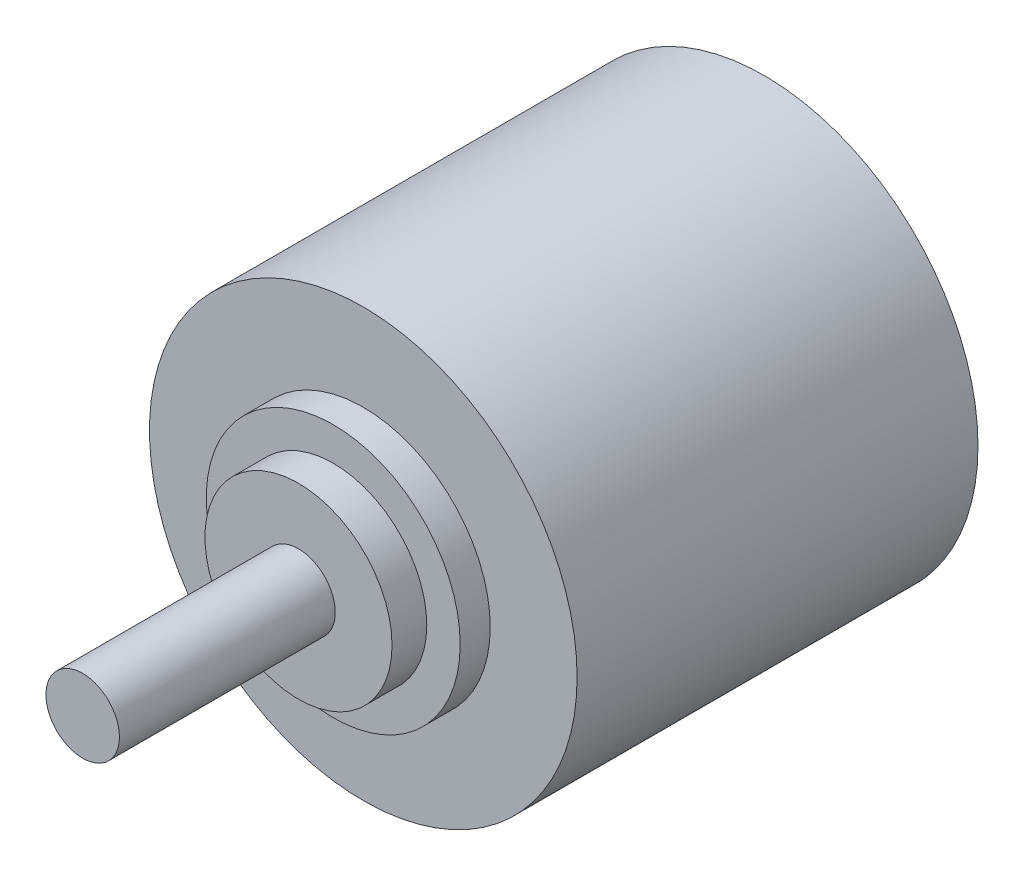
from build123d import *

# Parameters (mm, degrees)
SKETCH2_R           = 16
BOSS_EXTRUDE1_DEPTH = 30
SKETCH3_R           = 9.5
BOSS_EXTRUDE2_DEPTH = 2.25
SKETCH4_R           = 7
BOSS_EXTRUDE3_DEPTH = 2.6
SKETCH5_R           = 2.75
BOSS_EXTRUDE4_DEPTH = 16.15
SKETCH6_R           = 5
CUT_EXTRUDE1_DEPTH  = 2
SKETCH7_R           = 1.5
CUT_EXTRUDE2_DEPTH  = 9


with BuildPart() as part:
    # Sketch2 → Boss-Extrude1 (new body)
    with BuildSketch(Plane.XY):
        with Locations((-1.7905999, 0)):
            Circle(SKETCH2_R)
    extrude(amount=BOSS_EXTRUDE1_DEPTH)

    # Sketch3 → Boss-Extrude2 (add)
    with BuildSketch(Plane.XY.offset(30)):
        with Locations((-1.7905999, 0)):
            Circle(SKETCH3_R)
    extrude(amount=BOSS_EXTRUDE2_DEPTH)

    # Sketch4 → Boss-Extrude3 (add)
    with BuildSketch(Plane.XY.offset(32.25)):
        with Locations((-1.7905999, 0)):
            Circle(SKETCH4_R)
    extrude(amount=BOSS_EXTRUDE3_DEPTH)

    # Sketch5 → Boss-Extrude4 (add)
    with BuildSketch(Plane.XY.offset(34.85)):
        with Locations((-1.7905999, 0)):
            Circle(SKETCH5_R)
    extrude(amount=BOSS_EXTRUDE4_DEPTH)

    # Sketch6 → Cut-Extrude1 (cut)
    with BuildSketch(Plane(origin=(0, 0, 0), x_dir=(-1, 0, 0), z_dir=(0, 0, -1))):
        with Locations((1.7905999, 0)):
            Circle(SKETCH6_R)
    extrude(amount=-CUT_EXTRUDE1_DEPTH, mode=Mode.SUBTRACT)

    # Sketch7 → Cut-Extrude2 (cut)
    with BuildSketch(Plane(origin=(0, 0, 2), x_dir=(-1, 0, 0), z_dir=(0, 0, -1))):
        with Locations((1.7905999, 0)):
            Circle(SKETCH7_R)
    extrude(amount=-CUT_EXTRUDE2_DEPTH, mode=Mode.SUBTRACT)


solid = part.part
